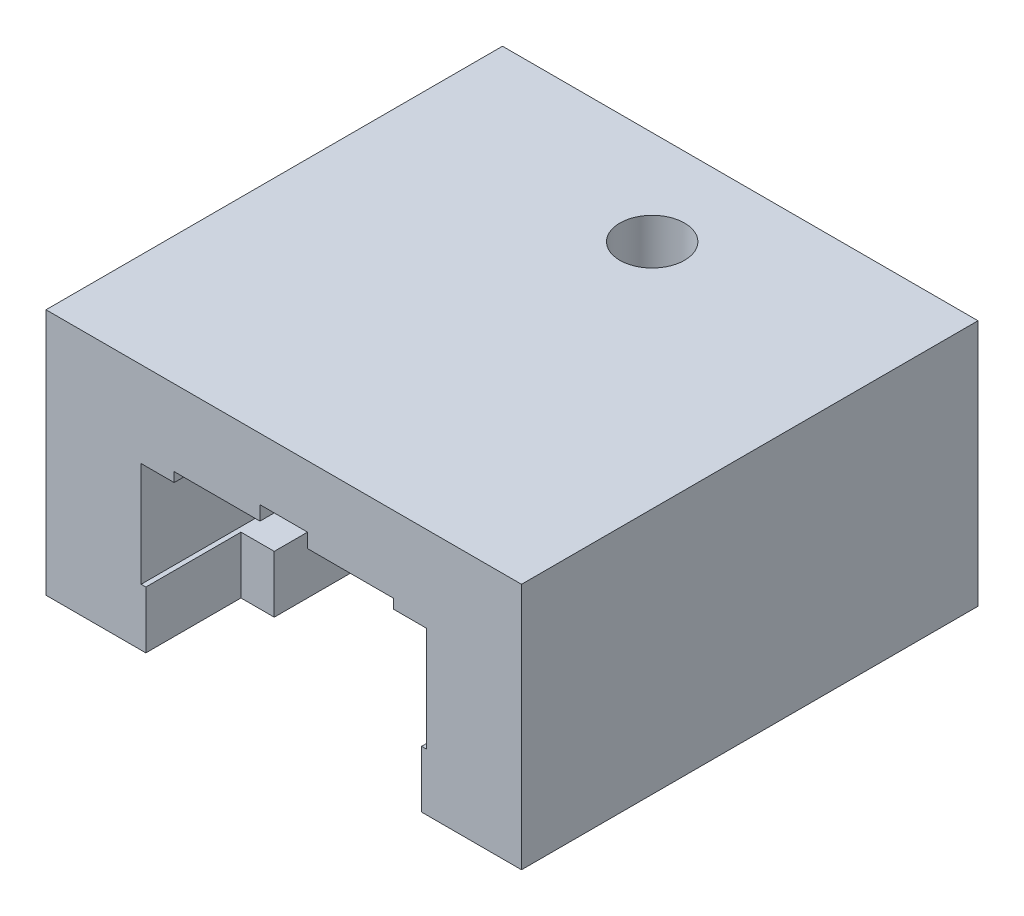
from build123d import *

# Parameters (mm, degrees)
BASE_EXTRUSION_DEPTH    = 48
ESQUISSE3_R             = 5
ENL_V_MAT_EXTRU_2_DEPTH = 6
ENL_V_MAT_EXTRU_3_DEPTH = 1
ENL_V_MAT_EXTRU_4_DEPTH = 1.5
ESQUISSE7_W             = 32
ESQUISSE7_H             = 16.401698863
ENL_V_MAT_EXTRU_5_DEPTH = 18
ESQUISSE9_W             = 29
ESQUISSE9_H             = 15.957060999
ENL_V_MAT_EXTRU_6_DEPTH = 17
CONG_4_R                = 3
PER_AGE1_D              = 6.8


with BuildPart() as part:
    # Esquisse1 → Base-Extrusion (new body)
    with BuildSketch(Plane.XY):
        Polygon((-25, 0), (25, 0), (25, -26), (11, -26), (11, -20), (15, -20), (15, -9), (-15, -9), (-15, -20), (-11, -20), (-11, -26), (-25, -26), align=None)
    extrude(amount=BASE_EXTRUSION_DEPTH)

    # Esquisse3 → Enl_v. mat.-Extru.2 (cut)
    with BuildSketch(Plane.XZ.offset(26)):
        with Locations((11, 24)):
            Circle(ESQUISSE3_R)
        with Locations((-11, 24)):
            Circle(ESQUISSE3_R)
    extrude(amount=-ENL_V_MAT_EXTRU_2_DEPTH, mode=Mode.SUBTRACT)

    # Esquisse5 → Enl_v. mat.-Extru.3 (cut)
    with BuildSketch(Plane.XZ.offset(9)):
        with BuildLine():
            Line((11.524544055, 25), (11.524544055, 51.747556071))
            Line((11.524544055, 51.747556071), (-11.524544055, 51.747556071))
            Line((-11.524544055, 51.747556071), (-11.524544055, 25))
            ThreePointArc((-11.524544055, 25), (0, 13.475455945), (11.524544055, 25))
        make_face()
    extrude(amount=-ENL_V_MAT_EXTRU_3_DEPTH, mode=Mode.SUBTRACT)

    # Esquisse6 → Enl_v. mat.-Extru.4 (cut)
    with BuildSketch(Plane.XZ.offset(8)):
        with BuildLine():
            Line((2.5, 40), (2.5, 51.028102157))
            Line((2.5, 51.028102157), (-2.5, 51.595464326))
            Line((-2.5, 51.595464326), (-2.5, 40))
            ThreePointArc((-2.5, 40), (0, 37.5), (2.5, 40))
        make_face()
    extrude(amount=-ENL_V_MAT_EXTRU_4_DEPTH, mode=Mode.SUBTRACT)

    # Esquisse7 → Enl_v. mat.-Extru.5 (cut)
    with BuildSketch(Plane.XZ.offset(26)):
        with Locations((0, -0.200849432)):
            Rectangle(ESQUISSE7_W, ESQUISSE7_H)
    extrude(amount=-ENL_V_MAT_EXTRU_5_DEPTH, mode=Mode.SUBTRACT)

    # Esquisse9 → Enl_v. mat.-Extru.6 (cut)
    with BuildSketch(Plane.XZ.offset(26)):
        with Locations((0, 45.9785305)):
            Rectangle(ESQUISSE9_W, ESQUISSE9_H)
    extrude(amount=-ENL_V_MAT_EXTRU_6_DEPTH, mode=Mode.SUBTRACT)

    # Cong_4
    cong_4_edges = [part.edges().sort_by_distance(p)[0] for p in [
        (16, -8, 4),
        (-16, -8, 4),
    ]]
    fillet(cong_4_edges, radius=CONG_4_R)

    # Per_age1 (through all)
    with Locations(Plane(origin=(0, 0, 0), x_dir=(-1, 0, 0), z_dir=(0, 1, 0))):
        with Locations((-0.671346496, 9.929231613)):
            Hole(PER_AGE1_D / 2)


solid = part.part
